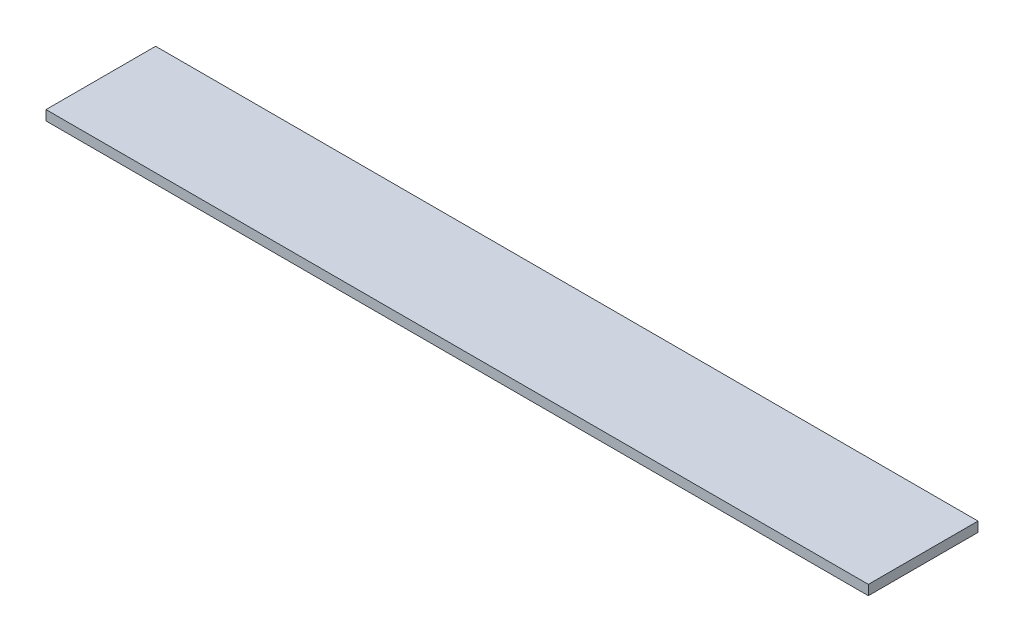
ISO-10303-21;
HEADER;
FILE_DESCRIPTION(('STEP AP214'),'2;1');
FILE_NAME('part.step','',(''),(''),'','','');
FILE_SCHEMA(('AUTOMOTIVE_DESIGN { 1 0 10303 214 1 1 1 1 }'));
ENDSEC;
DATA;
#1=APPLICATION_CONTEXT('core data for automotive mechanical design processes');
#2=APPLICATION_PROTOCOL_DEFINITION('international standard','automotive_design',2000,#1);
#3=PRODUCT_CONTEXT('',#1,'mechanical');
#4=PRODUCT('Part','Part','',(#3));
#5=PRODUCT_RELATED_PRODUCT_CATEGORY('part','',(#4));
#6=PRODUCT_DEFINITION_FORMATION('','',#4);
#7=PRODUCT_DEFINITION_CONTEXT('part definition',#1,'design');
#8=PRODUCT_DEFINITION('design','',#6,#7);
#9=PRODUCT_DEFINITION_SHAPE('','',#8);
#10=(LENGTH_UNIT() NAMED_UNIT(*) SI_UNIT(.MILLI.,.METRE.));
#11=(NAMED_UNIT(*) PLANE_ANGLE_UNIT() SI_UNIT($,.RADIAN.));
#12=(NAMED_UNIT(*) SI_UNIT($,.STERADIAN.) SOLID_ANGLE_UNIT());
#13=UNCERTAINTY_MEASURE_WITH_UNIT(LENGTH_MEASURE(1.E-05),#10,'distance_accuracy_value','');
#14=(GEOMETRIC_REPRESENTATION_CONTEXT(3) GLOBAL_UNCERTAINTY_ASSIGNED_CONTEXT((#13)) GLOBAL_UNIT_ASSIGNED_CONTEXT((#10,
#11,#12)) REPRESENTATION_CONTEXT('',''));
#15=CARTESIAN_POINT('',(0.,0.,0.));
#16=DIRECTION('',(0.,0.,1.));
#17=DIRECTION('',(1.,0.,0.));
#18=AXIS2_PLACEMENT_3D('',#15,#16,#17);
#19=CARTESIAN_POINT('',(750.,18.,100.));
#20=DIRECTION('',(-1.,0.,0.));
#21=DIRECTION('',(0.,0.,1.));
#22=AXIS2_PLACEMENT_3D('',#19,#20,#21);
#23=PLANE('',#22);
#24=DIRECTION('',(0.,0.,-1.));
#25=VECTOR('',#24,1.);
#26=CARTESIAN_POINT('',(750.,0.,100.));
#27=LINE('',#26,#25);
#28=CARTESIAN_POINT('',(750.,0.,100.));
#29=VERTEX_POINT('',#28);
#30=CARTESIAN_POINT('',(750.,0.,-100.));
#31=VERTEX_POINT('',#30);
#32=EDGE_CURVE('E96',#29,#31,#27,.T.);
#33=ORIENTED_EDGE('',*,*,#32,.T.);
#34=DIRECTION('',(0.,-1.,0.));
#35=VECTOR('',#34,1.);
#36=CARTESIAN_POINT('',(750.,18.,-100.));
#37=LINE('',#36,#35);
#38=CARTESIAN_POINT('',(750.,18.,-100.));
#39=VERTEX_POINT('',#38);
#40=EDGE_CURVE('E11',#39,#31,#37,.T.);
#41=ORIENTED_EDGE('',*,*,#40,.F.);
#42=DIRECTION('',(0.,0.,-1.));
#43=VECTOR('',#42,1.);
#44=CARTESIAN_POINT('',(750.,18.,100.));
#45=LINE('',#44,#43);
#46=CARTESIAN_POINT('',(750.,18.,100.));
#47=VERTEX_POINT('',#46);
#48=EDGE_CURVE('E84',#47,#39,#45,.T.);
#49=ORIENTED_EDGE('',*,*,#48,.F.);
#50=DIRECTION('',(0.,-1.,0.));
#51=VECTOR('',#50,1.);
#52=CARTESIAN_POINT('',(750.,18.,100.));
#53=LINE('',#52,#51);
#54=EDGE_CURVE('E92',#47,#29,#53,.T.);
#55=ORIENTED_EDGE('',*,*,#54,.T.);
#56=EDGE_LOOP('',(#33,#41,#49,#55));
#57=FACE_BOUND('',#56,.T.);
#58=ADVANCED_FACE('F33',(#57),#23,.F.);
#59=CARTESIAN_POINT('',(-750.,18.,-100.));
#60=DIRECTION('',(0.,0.,1.));
#61=DIRECTION('',(1.,0.,0.));
#62=AXIS2_PLACEMENT_3D('',#59,#60,#61);
#63=PLANE('',#62);
#64=DIRECTION('',(-1.,0.,0.));
#65=VECTOR('',#64,1.);
#66=CARTESIAN_POINT('',(-750.,0.,-100.));
#67=LINE('',#66,#65);
#68=CARTESIAN_POINT('',(-750.,0.,-100.));
#69=VERTEX_POINT('',#68);
#70=EDGE_CURVE('E88',#31,#69,#67,.T.);
#71=ORIENTED_EDGE('',*,*,#70,.T.);
#72=DIRECTION('',(0.,-1.,0.));
#73=VECTOR('',#72,1.);
#74=CARTESIAN_POINT('',(-750.,18.,-100.));
#75=LINE('',#74,#73);
#76=CARTESIAN_POINT('',(-750.,18.,-100.));
#77=VERTEX_POINT('',#76);
#78=EDGE_CURVE('E41',#77,#69,#75,.T.);
#79=ORIENTED_EDGE('',*,*,#78,.F.);
#80=DIRECTION('',(-1.,0.,0.));
#81=VECTOR('',#80,1.);
#82=CARTESIAN_POINT('',(-750.,18.,-100.));
#83=LINE('',#82,#81);
#84=EDGE_CURVE('E79',#39,#77,#83,.T.);
#85=ORIENTED_EDGE('',*,*,#84,.F.);
#86=ORIENTED_EDGE('',*,*,#40,.T.);
#87=EDGE_LOOP('',(#71,#79,#85,#86));
#88=FACE_BOUND('',#87,.T.);
#89=ADVANCED_FACE('F87',(#88),#63,.F.);
#90=CARTESIAN_POINT('',(-750.,18.,100.));
#91=DIRECTION('',(1.,0.,0.));
#92=DIRECTION('',(0.,0.,-1.));
#93=AXIS2_PLACEMENT_3D('',#90,#91,#92);
#94=PLANE('',#93);
#95=DIRECTION('',(0.,0.,1.));
#96=VECTOR('',#95,1.);
#97=CARTESIAN_POINT('',(-750.,0.,100.));
#98=LINE('',#97,#96);
#99=CARTESIAN_POINT('',(-750.,0.,100.));
#100=VERTEX_POINT('',#99);
#101=EDGE_CURVE('E66',#69,#100,#98,.T.);
#102=ORIENTED_EDGE('',*,*,#101,.T.);
#103=DIRECTION('',(0.,-1.,0.));
#104=VECTOR('',#103,1.);
#105=CARTESIAN_POINT('',(-750.,18.,100.));
#106=LINE('',#105,#104);
#107=CARTESIAN_POINT('',(-750.,18.,100.));
#108=VERTEX_POINT('',#107);
#109=EDGE_CURVE('E89',#108,#100,#106,.T.);
#110=ORIENTED_EDGE('',*,*,#109,.F.);
#111=DIRECTION('',(0.,0.,1.));
#112=VECTOR('',#111,1.);
#113=CARTESIAN_POINT('',(-750.,18.,100.));
#114=LINE('',#113,#112);
#115=EDGE_CURVE('E82',#77,#108,#114,.T.);
#116=ORIENTED_EDGE('',*,*,#115,.F.);
#117=ORIENTED_EDGE('',*,*,#78,.T.);
#118=EDGE_LOOP('',(#102,#110,#116,#117));
#119=FACE_BOUND('',#118,.T.);
#120=ADVANCED_FACE('F90',(#119),#94,.F.);
#121=CARTESIAN_POINT('',(-750.,18.,100.));
#122=DIRECTION('',(0.,0.,-1.));
#123=DIRECTION('',(-1.,0.,0.));
#124=AXIS2_PLACEMENT_3D('',#121,#122,#123);
#125=PLANE('',#124);
#126=DIRECTION('',(1.,0.,0.));
#127=VECTOR('',#126,1.);
#128=CARTESIAN_POINT('',(-750.,0.,100.));
#129=LINE('',#128,#127);
#130=EDGE_CURVE('E72',#100,#29,#129,.T.);
#131=ORIENTED_EDGE('',*,*,#130,.T.);
#132=ORIENTED_EDGE('',*,*,#54,.F.);
#133=DIRECTION('',(1.,0.,0.));
#134=VECTOR('',#133,1.);
#135=CARTESIAN_POINT('',(-750.,18.,100.));
#136=LINE('',#135,#134);
#137=EDGE_CURVE('E49',#108,#47,#136,.T.);
#138=ORIENTED_EDGE('',*,*,#137,.F.);
#139=ORIENTED_EDGE('',*,*,#109,.T.);
#140=EDGE_LOOP('',(#131,#132,#138,#139));
#141=FACE_BOUND('',#140,.T.);
#142=ADVANCED_FACE('F103',(#141),#125,.F.);
#143=CARTESIAN_POINT('',(0.,18.,0.));
#144=DIRECTION('',(0.,-1.,0.));
#145=DIRECTION('',(0.,0.,-1.));
#146=AXIS2_PLACEMENT_3D('',#143,#144,#145);
#147=PLANE('',#146);
#148=ORIENTED_EDGE('',*,*,#48,.T.);
#149=ORIENTED_EDGE('',*,*,#84,.T.);
#150=ORIENTED_EDGE('',*,*,#115,.T.);
#151=ORIENTED_EDGE('',*,*,#137,.T.);
#152=EDGE_LOOP('',(#148,#149,#150,#151));
#153=FACE_BOUND('',#152,.T.);
#154=ADVANCED_FACE('F80',(#153),#147,.F.);
#155=CARTESIAN_POINT('',(0.,0.,0.));
#156=DIRECTION('',(0.,-1.,0.));
#157=DIRECTION('',(0.,0.,-1.));
#158=AXIS2_PLACEMENT_3D('',#155,#156,#157);
#159=PLANE('',#158);
#160=ORIENTED_EDGE('',*,*,#32,.F.);
#161=ORIENTED_EDGE('',*,*,#130,.F.);
#162=ORIENTED_EDGE('',*,*,#101,.F.);
#163=ORIENTED_EDGE('',*,*,#70,.F.);
#164=EDGE_LOOP('',(#160,#161,#162,#163));
#165=FACE_BOUND('',#164,.T.);
#166=ADVANCED_FACE('F106',(#165),#159,.T.);
#167=CLOSED_SHELL('',(#58,#89,#120,#142,#154,#166));
#168=MANIFOLD_SOLID_BREP('B2',#167);
#169=ADVANCED_BREP_SHAPE_REPRESENTATION('',(#18,#168),#14);
#170=SHAPE_DEFINITION_REPRESENTATION(#9,#169);
ENDSEC;
END-ISO-10303-21;
